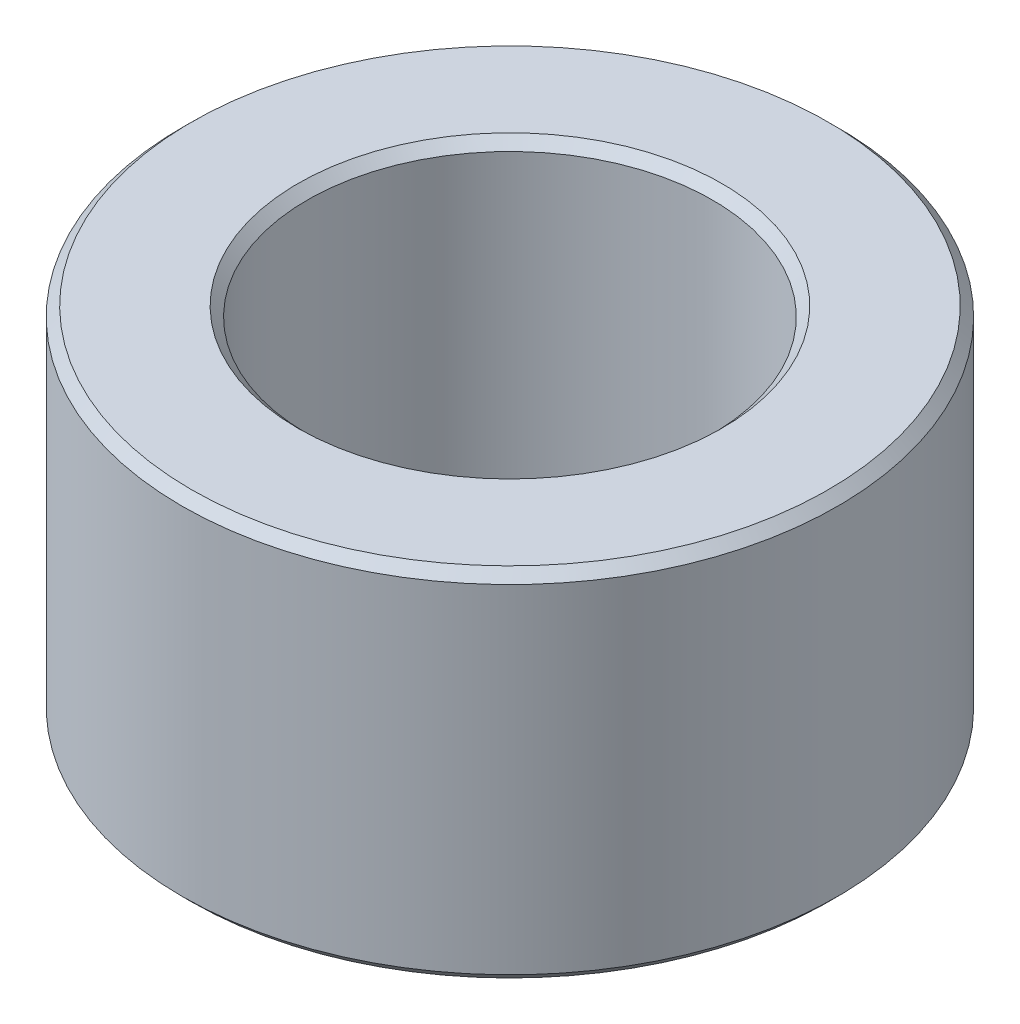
from build123d import *

# Parameters (mm, degrees)
SKETCH2_R           = 8.636
SKETCH2_R_2         = 5.334
EXTRUDE_THIN1_DEPTH = 4.7
CHAMFER1_SIZE       = 0.25


with BuildPart() as part:
    # Sketch2 → Extrude-Thin1 (new, symmetric)
    with BuildSketch(Plane(origin=(0, 0, 0), x_dir=(1, 0, 0), z_dir=(0, 1, 0))):
        Circle(SKETCH2_R)
        Circle(SKETCH2_R_2, mode=Mode.SUBTRACT)
    extrude(amount=EXTRUDE_THIN1_DEPTH, both=True)

    # Chamfer1
    chamfer1_edges = [part.edges().sort_by_distance(p)[0] for p in [
        (-8.636, -4.7, 0),
        (-8.636, 4.7, 0),
        (-5.334, -4.7, 0),
        (-5.334, 4.7, 0),
    ]]
    chamfer(chamfer1_edges, length=CHAMFER1_SIZE)


solid = part.part
